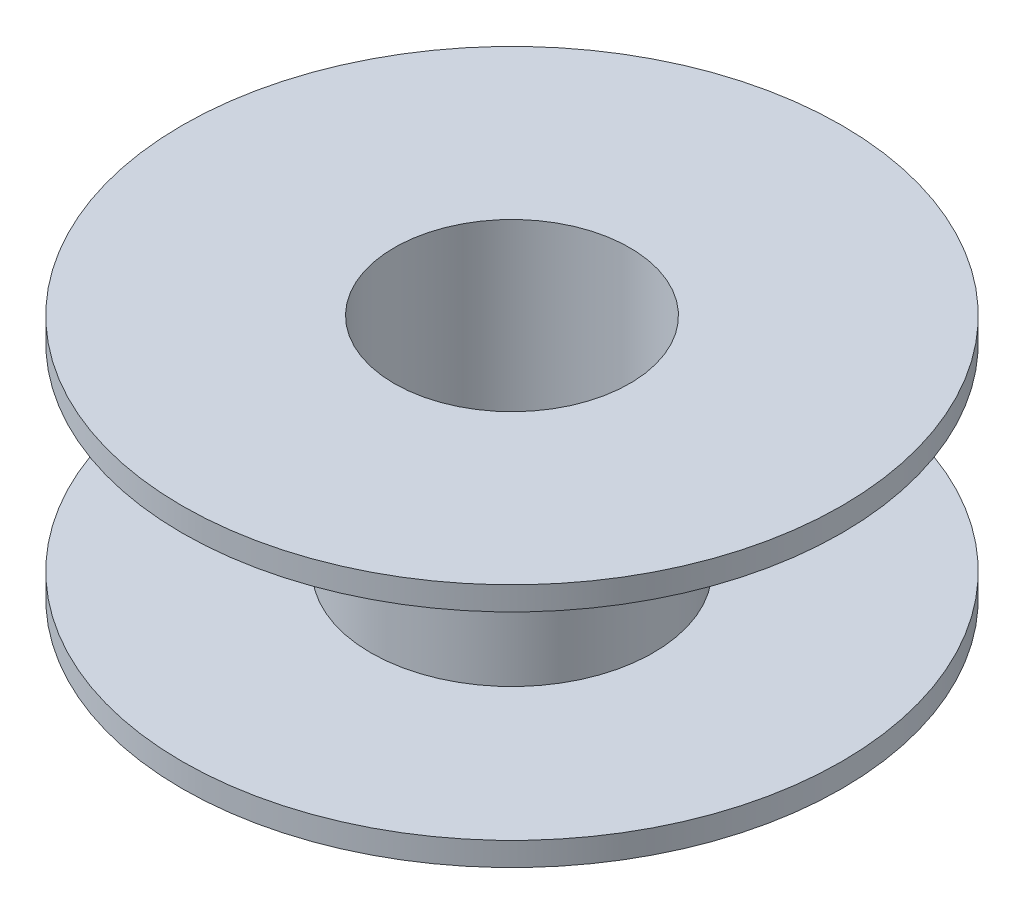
from build123d import *


with BuildPart() as part:
    # Sketch 1 → Revolve 1 (revolve)
    with BuildSketch(Plane.XY, mode=Mode.PRIVATE) as revolve_1_sk:
        Polygon((-2.5, 2.6), (-7, 2.6), (-7, 2.1), (-3, 2.1), (-3, -2.1), (-7, -2.1), (-7, -2.6), (-2.5, -2.6), align=None)
    revolve(revolve_1_sk.sketch.rotate(Axis((0, 3.545454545, 0), (0, -1, 0)), 270), axis=Axis((0, 3.545454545, 0), (0, -1, 0)))


solid = part.part
